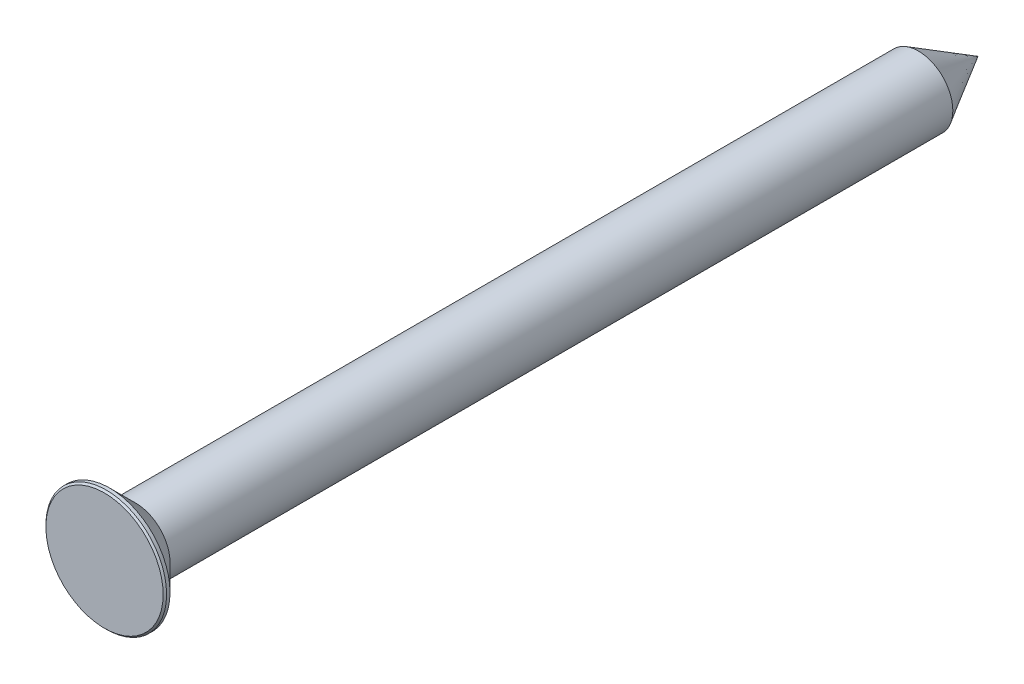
from build123d import *


with BuildPart() as part:
    # Sketch 1 → Revolve 1 (revolve)
    with BuildSketch(Plane(origin=(0, 0, 0), x_dir=(0, 0, -1), z_dir=(1, 0, 0)), mode=Mode.PRIVATE) as revolve_1_sk:
        Polygon((0, 0), (50.8, 0), (47.335898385, 2), (1.81, 2), (0.3, 3.51), (0.1, 3.51), (0, 3.41), align=None)
    revolve(revolve_1_sk.sketch.rotate(Axis((0, 0, 0), (0, 0, -1)), 90), axis=Axis((0, 0, 0), (0, 0, -1)))


solid = part.part
